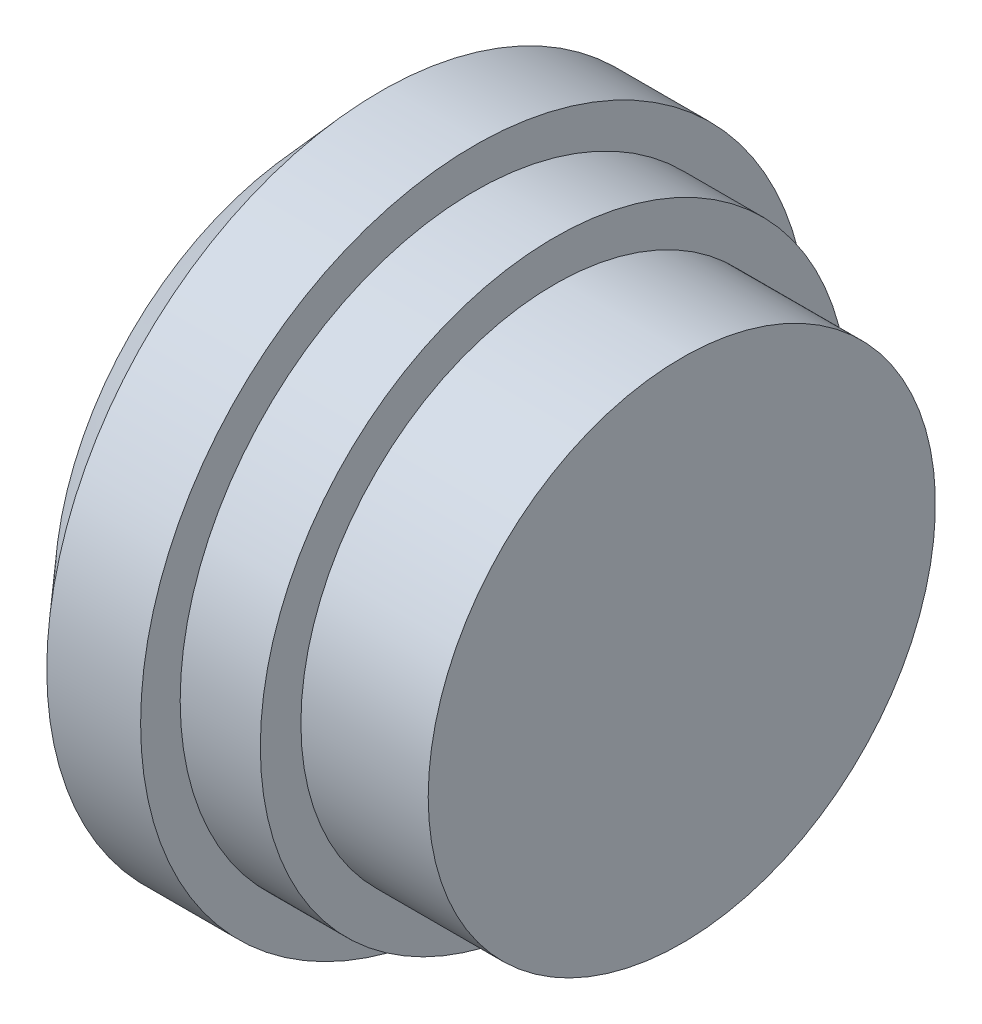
ISO-10303-21;
HEADER;
FILE_DESCRIPTION(('STEP AP214'),'2;1');
FILE_NAME('part.step','',(''),(''),'','','');
FILE_SCHEMA(('AUTOMOTIVE_DESIGN { 1 0 10303 214 1 1 1 1 }'));
ENDSEC;
DATA;
#1=APPLICATION_CONTEXT('core data for automotive mechanical design processes');
#2=APPLICATION_PROTOCOL_DEFINITION('international standard','automotive_design',2000,#1);
#3=PRODUCT_CONTEXT('',#1,'mechanical');
#4=PRODUCT('Part','Part','',(#3));
#5=PRODUCT_RELATED_PRODUCT_CATEGORY('part','',(#4));
#6=PRODUCT_DEFINITION_FORMATION('','',#4);
#7=PRODUCT_DEFINITION_CONTEXT('part definition',#1,'design');
#8=PRODUCT_DEFINITION('design','',#6,#7);
#9=PRODUCT_DEFINITION_SHAPE('','',#8);
#10=(LENGTH_UNIT() NAMED_UNIT(*) SI_UNIT(.MILLI.,.METRE.));
#11=(NAMED_UNIT(*) PLANE_ANGLE_UNIT() SI_UNIT($,.RADIAN.));
#12=(NAMED_UNIT(*) SI_UNIT($,.STERADIAN.) SOLID_ANGLE_UNIT());
#13=UNCERTAINTY_MEASURE_WITH_UNIT(LENGTH_MEASURE(1.E-05),#10,'distance_accuracy_value','');
#14=(GEOMETRIC_REPRESENTATION_CONTEXT(3) GLOBAL_UNCERTAINTY_ASSIGNED_CONTEXT((#13)) GLOBAL_UNIT_ASSIGNED_CONTEXT((#10,
#11,#12)) REPRESENTATION_CONTEXT('',''));
#15=CARTESIAN_POINT('',(0.,0.,0.));
#16=DIRECTION('',(0.,0.,1.));
#17=DIRECTION('',(1.,0.,0.));
#18=AXIS2_PLACEMENT_3D('',#15,#16,#17);
#19=CARTESIAN_POINT('',(0.,12.7,0.));
#20=DIRECTION('',(1.,0.,0.));
#21=DIRECTION('',(0.,0.,-1.));
#22=AXIS2_PLACEMENT_3D('',#19,#20,#21);
#23=PLANE('',#22);
#24=CARTESIAN_POINT('',(0.,12.7,0.));
#25=DIRECTION('',(-1.,0.,0.));
#26=DIRECTION('',(0.,0.,1.));
#27=AXIS2_PLACEMENT_3D('',#24,#25,#26);
#28=CIRCLE('',#27,12.7);
#29=CARTESIAN_POINT('',(0.,12.7,12.7));
#30=VERTEX_POINT('',#29);
#31=EDGE_CURVE('E10',#30,#30,#28,.T.);
#32=ORIENTED_EDGE('',*,*,#31,.F.);
#33=EDGE_LOOP('',(#32));
#34=FACE_BOUND('',#33,.T.);
#35=ADVANCED_FACE('F31',(#34),#23,.T.);
#36=CARTESIAN_POINT('',(-18.288,12.7,0.));
#37=DIRECTION('',(-1.,0.,0.));
#38=DIRECTION('',(0.,0.,1.));
#39=AXIS2_PLACEMENT_3D('',#36,#37,#38);
#40=CYLINDRICAL_SURFACE('',#39,12.7);
#41=ORIENTED_EDGE('',*,*,#31,.T.);
#42=EDGE_LOOP('',(#41));
#43=FACE_BOUND('',#42,.T.);
#44=CARTESIAN_POINT('',(-6.3754,12.7,0.));
#45=DIRECTION('',(-1.,0.,0.));
#46=DIRECTION('',(0.,0.,1.));
#47=AXIS2_PLACEMENT_3D('',#44,#45,#46);
#48=CIRCLE('',#47,12.7);
#49=CARTESIAN_POINT('',(-6.3754,12.7,12.7));
#50=VERTEX_POINT('',#49);
#51=EDGE_CURVE('E37',#50,#50,#48,.T.);
#52=ORIENTED_EDGE('',*,*,#51,.F.);
#53=EDGE_LOOP('',(#52));
#54=FACE_BOUND('',#53,.T.);
#55=ADVANCED_FACE('F92',(#43,#54),#40,.T.);
#56=CARTESIAN_POINT('',(-6.3754,0.,0.));
#57=DIRECTION('',(1.,0.,0.));
#58=DIRECTION('',(0.,0.,-1.));
#59=AXIS2_PLACEMENT_3D('',#56,#57,#58);
#60=PLANE('',#59);
#61=ORIENTED_EDGE('',*,*,#51,.T.);
#62=EDGE_LOOP('',(#61));
#63=FACE_BOUND('',#62,.T.);
#64=CARTESIAN_POINT('',(-6.3754,12.7,0.));
#65=DIRECTION('',(-1.,0.,0.));
#66=DIRECTION('',(0.,0.,1.));
#67=AXIS2_PLACEMENT_3D('',#64,#65,#66);
#68=CIRCLE('',#67,14.732);
#69=CARTESIAN_POINT('',(-6.3754,12.7,14.732));
#70=VERTEX_POINT('',#69);
#71=EDGE_CURVE('E41',#70,#70,#68,.T.);
#72=ORIENTED_EDGE('',*,*,#71,.F.);
#73=EDGE_LOOP('',(#72));
#74=FACE_BOUND('',#73,.T.);
#75=ADVANCED_FACE('F97',(#63,#74),#60,.T.);
#76=CARTESIAN_POINT('',(-18.288,12.7,0.));
#77=DIRECTION('',(-1.,0.,0.));
#78=DIRECTION('',(0.,0.,1.));
#79=AXIS2_PLACEMENT_3D('',#76,#77,#78);
#80=CYLINDRICAL_SURFACE('',#79,14.732);
#81=ORIENTED_EDGE('',*,*,#71,.T.);
#82=EDGE_LOOP('',(#81));
#83=FACE_BOUND('',#82,.T.);
#84=CARTESIAN_POINT('',(-10.3886,12.7,0.));
#85=DIRECTION('',(-1.,0.,0.));
#86=DIRECTION('',(0.,0.,1.));
#87=AXIS2_PLACEMENT_3D('',#84,#85,#86);
#88=CIRCLE('',#87,14.732);
#89=CARTESIAN_POINT('',(-10.3886,12.7,14.732));
#90=VERTEX_POINT('',#89);
#91=EDGE_CURVE('E45',#90,#90,#88,.T.);
#92=ORIENTED_EDGE('',*,*,#91,.F.);
#93=EDGE_LOOP('',(#92));
#94=FACE_BOUND('',#93,.T.);
#95=ADVANCED_FACE('F101',(#83,#94),#80,.T.);
#96=CARTESIAN_POINT('',(-10.3886,-2.032,0.));
#97=DIRECTION('',(1.,0.,0.));
#98=DIRECTION('',(0.,0.,-1.));
#99=AXIS2_PLACEMENT_3D('',#96,#97,#98);
#100=PLANE('',#99);
#101=ORIENTED_EDGE('',*,*,#91,.T.);
#102=EDGE_LOOP('',(#101));
#103=FACE_BOUND('',#102,.T.);
#104=CARTESIAN_POINT('',(-10.3886,12.7,0.));
#105=DIRECTION('',(-1.,0.,0.));
#106=DIRECTION('',(0.,0.,1.));
#107=AXIS2_PLACEMENT_3D('',#104,#105,#106);
#108=CIRCLE('',#107,16.7132);
#109=CARTESIAN_POINT('',(-10.3886,12.7,16.7132));
#110=VERTEX_POINT('',#109);
#111=EDGE_CURVE('E50',#110,#110,#108,.T.);
#112=ORIENTED_EDGE('',*,*,#111,.F.);
#113=EDGE_LOOP('',(#112));
#114=FACE_BOUND('',#113,.T.);
#115=ADVANCED_FACE('F88',(#103,#114),#100,.T.);
#116=CARTESIAN_POINT('',(-18.288,12.7,0.));
#117=DIRECTION('',(-1.,0.,0.));
#118=DIRECTION('',(0.,0.,1.));
#119=AXIS2_PLACEMENT_3D('',#116,#117,#118);
#120=CYLINDRICAL_SURFACE('',#119,16.7132);
#121=ORIENTED_EDGE('',*,*,#111,.T.);
#122=EDGE_LOOP('',(#121));
#123=FACE_BOUND('',#122,.T.);
#124=CARTESIAN_POINT('',(-15.0876,12.7,0.));
#125=DIRECTION('',(-1.,0.,0.));
#126=DIRECTION('',(0.,0.,1.));
#127=AXIS2_PLACEMENT_3D('',#124,#125,#126);
#128=CIRCLE('',#127,16.7132);
#129=CARTESIAN_POINT('',(-15.0876,12.7,16.7132));
#130=VERTEX_POINT('',#129);
#131=EDGE_CURVE('E53',#130,#130,#128,.T.);
#132=ORIENTED_EDGE('',*,*,#131,.F.);
#133=EDGE_LOOP('',(#132));
#134=FACE_BOUND('',#133,.T.);
#135=ADVANCED_FACE('F82',(#123,#134),#120,.T.);
#136=CARTESIAN_POINT('',(-18.288,12.7,0.));
#137=DIRECTION('',(1.,0.,0.));
#138=DIRECTION('',(0.,0.,-1.));
#139=AXIS2_PLACEMENT_3D('',#136,#137,#138);
#140=CONICAL_SURFACE('',#139,13.1318,0.841518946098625);
#141=ORIENTED_EDGE('',*,*,#131,.T.);
#142=EDGE_LOOP('',(#141));
#143=FACE_BOUND('',#142,.T.);
#144=CARTESIAN_POINT('',(-18.288,12.7,0.));
#145=DIRECTION('',(-1.,0.,0.));
#146=DIRECTION('',(0.,0.,1.));
#147=AXIS2_PLACEMENT_3D('',#144,#145,#146);
#148=CIRCLE('',#147,13.1318);
#149=CARTESIAN_POINT('',(-18.288,12.7,13.1318));
#150=VERTEX_POINT('',#149);
#151=EDGE_CURVE('E56',#150,#150,#148,.T.);
#152=ORIENTED_EDGE('',*,*,#151,.F.);
#153=EDGE_LOOP('',(#152));
#154=FACE_BOUND('',#153,.T.);
#155=ADVANCED_FACE('F77',(#143,#154),#140,.T.);
#156=CARTESIAN_POINT('',(-18.288,-0.431800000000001,0.));
#157=DIRECTION('',(-1.,0.,0.));
#158=DIRECTION('',(0.,0.,1.));
#159=AXIS2_PLACEMENT_3D('',#156,#157,#158);
#160=PLANE('',#159);
#161=CARTESIAN_POINT('',(-18.288,12.7,0.));
#162=DIRECTION('',(-1.,0.,0.));
#163=DIRECTION('',(0.,0.,1.));
#164=AXIS2_PLACEMENT_3D('',#161,#162,#163);
#165=CIRCLE('',#164,11.049);
#166=CARTESIAN_POINT('',(-18.288,12.7,11.049));
#167=VERTEX_POINT('',#166);
#168=EDGE_CURVE('E60',#167,#167,#165,.T.);
#169=ORIENTED_EDGE('',*,*,#168,.F.);
#170=EDGE_LOOP('',(#169));
#171=FACE_BOUND('',#170,.T.);
#172=ORIENTED_EDGE('',*,*,#151,.T.);
#173=EDGE_LOOP('',(#172));
#174=FACE_BOUND('',#173,.T.);
#175=ADVANCED_FACE('F71',(#171,#174),#160,.T.);
#176=CARTESIAN_POINT('',(-0.8255,12.7,0.));
#177=DIRECTION('',(-1.,0.,0.));
#178=DIRECTION('',(0.,0.,1.));
#179=AXIS2_PLACEMENT_3D('',#176,#177,#178);
#180=CYLINDRICAL_SURFACE('',#179,11.049);
#181=CARTESIAN_POINT('',(-0.8255,12.7,0.));
#182=DIRECTION('',(-1.,0.,0.));
#183=DIRECTION('',(0.,0.,1.));
#184=AXIS2_PLACEMENT_3D('',#181,#182,#183);
#185=CIRCLE('',#184,11.049);
#186=CARTESIAN_POINT('',(-0.8255,12.7,11.049));
#187=VERTEX_POINT('',#186);
#188=EDGE_CURVE('E59',#187,#187,#185,.T.);
#189=ORIENTED_EDGE('',*,*,#188,.F.);
#190=EDGE_LOOP('',(#189));
#191=FACE_BOUND('',#190,.T.);
#192=ORIENTED_EDGE('',*,*,#168,.T.);
#193=EDGE_LOOP('',(#192));
#194=FACE_BOUND('',#193,.T.);
#195=ADVANCED_FACE('F68',(#191,#194),#180,.F.);
#196=CARTESIAN_POINT('',(-0.8255,12.7,0.));
#197=DIRECTION('',(-1.,0.,0.));
#198=DIRECTION('',(0.,0.,1.));
#199=AXIS2_PLACEMENT_3D('',#196,#197,#198);
#200=PLANE('',#199);
#201=ORIENTED_EDGE('',*,*,#188,.T.);
#202=EDGE_LOOP('',(#201));
#203=FACE_BOUND('',#202,.T.);
#204=ADVANCED_FACE('F66',(#203),#200,.T.);
#205=CLOSED_SHELL('',(#35,#55,#75,#95,#115,#135,#155,#175,#195,#204));
#206=MANIFOLD_SOLID_BREP('B2',#205);
#207=ADVANCED_BREP_SHAPE_REPRESENTATION('',(#18,#206),#14);
#208=SHAPE_DEFINITION_REPRESENTATION(#9,#207);
ENDSEC;
END-ISO-10303-21;
